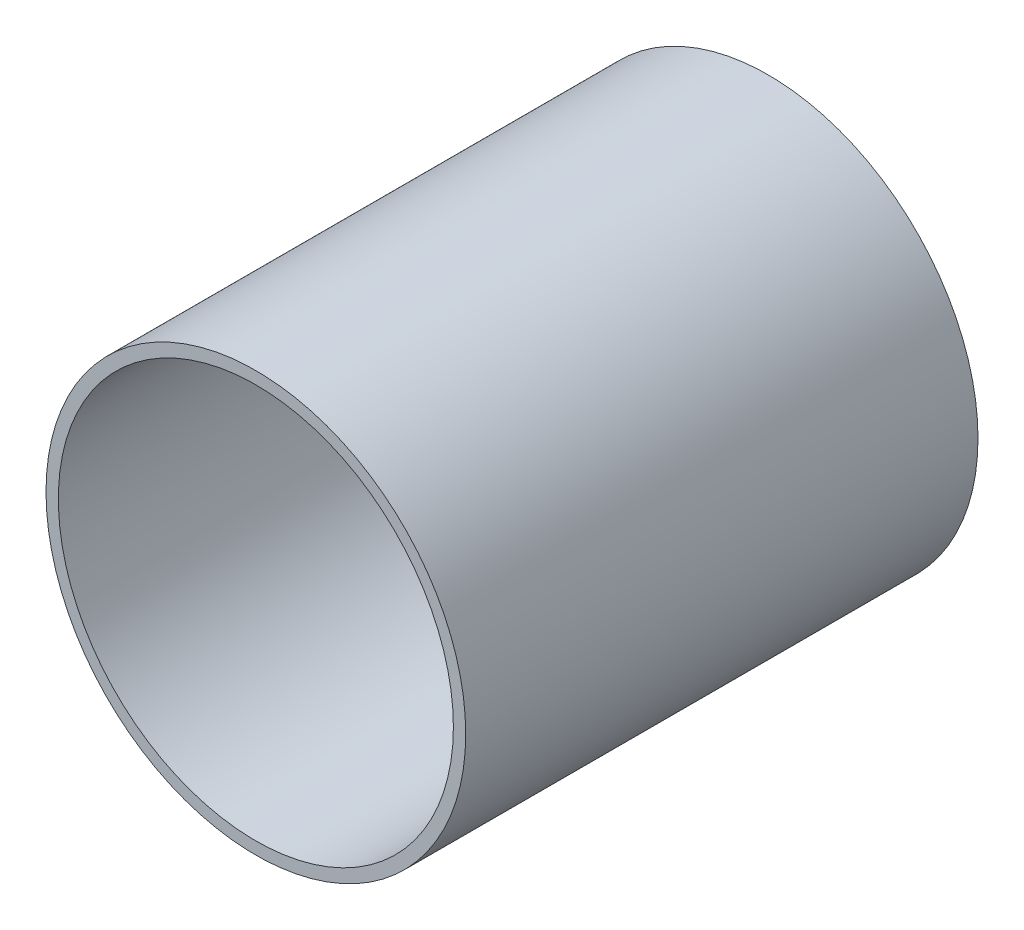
from build123d import *

# Parameters (mm, degrees)
SKETCH1_R           = 53.975
SKETCH1_R_2         = 50.8
BOSS_EXTRUDE1_DEPTH = 127
BOSS_EXTRUDE2_START = 4.7498
SKETCH2_R           = 53.975
BOSS_EXTRUDE2_DEPTH = 4.7498


with BuildPart() as part:
    # Sketch1 → Boss-Extrude1 (new body)
    with BuildSketch(Plane.XY):
        Circle(SKETCH1_R)
        Circle(SKETCH1_R_2, mode=Mode.SUBTRACT)
    extrude(amount=BOSS_EXTRUDE1_DEPTH)

    # Sketch2 → Boss-Extrude2 (add)
    with BuildSketch(Plane(origin=(0, 0, 0), x_dir=(-1, 0, 0), z_dir=(0, 0, -1)).offset(BOSS_EXTRUDE2_START)):
        Circle(SKETCH2_R)
    extrude(amount=-BOSS_EXTRUDE2_DEPTH)


solid = part.part
